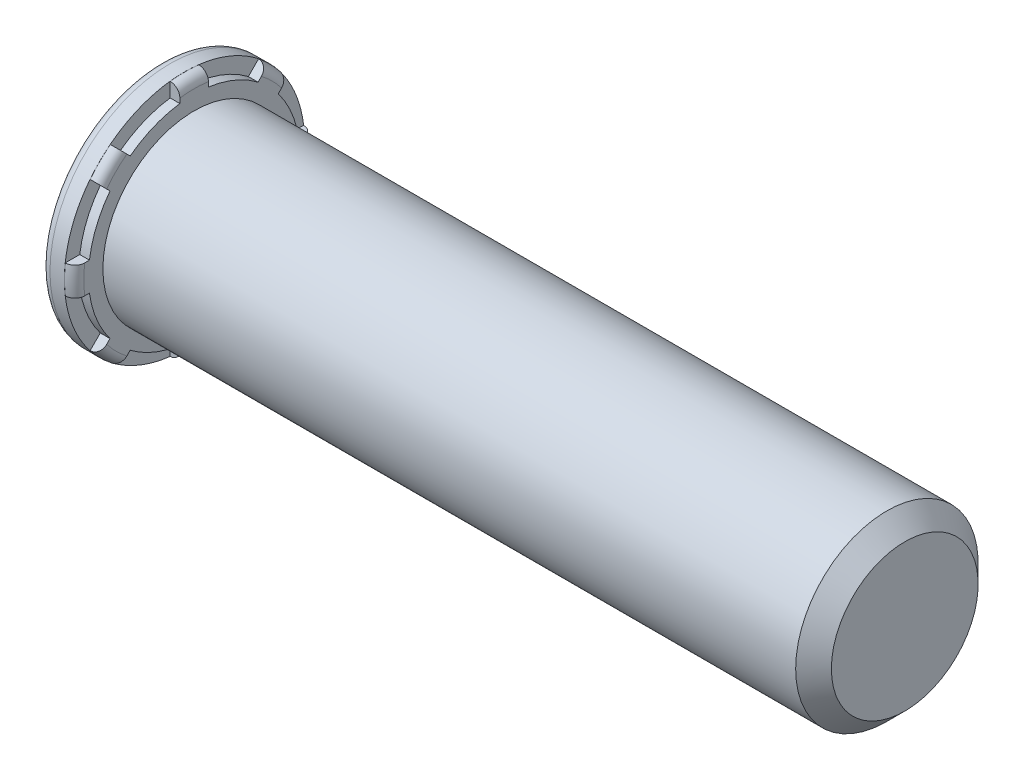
from build123d import *

# Parameters (mm, degrees)
RIBCUT_START     = -0.25654
RIBCUT_DEPTH     = 0.25654
RIBCUTSPAT_COUNT = 8
RIBCUTSPAT_ANGLE = 315


with BuildPart() as part:
    # BodySke → BaseBody (revolve)
    with BuildSketch(Plane.XY, mode=Mode.PRIVATE) as basebody_sk:
        with BuildLine():
            Line((-0.635, 2.921), (-0.635, 0))
            Line((-0.635, 0), (19.05, 0))
            Line((19.05, 0), (19.05, 1.94056))
            Line((19.05, 1.94056), (18.57756, 2.413))
            Line((18.57756, 2.413), (0.25654, 2.413))
            Line((0.25654, 2.413), (0.25654, 2.91846))
            ThreePointArc((0.25654, 2.91846), (0.182145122, 3.098065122), (0.00254, 3.17246))
            Line((0.00254, 3.17246), (0, 3.17246))
            Line((0, 3.17246), (0, 3.175))
            Line((0, 3.175), (-0.381, 3.175))
            ThreePointArc((-0.381, 3.175), (-0.560605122, 3.100605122), (-0.635, 2.921))
        make_face()
    revolve(basebody_sk.sketch.rotate(Axis((0, 0, 0), (1, 0, 0)), 90), axis=Axis((0, 0, 0), (1, 0, 0)))

    # RibCutSke → RibCut (cut)
    with BuildSketch(Plane(origin=(0.25654, 1.794401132, -0.090952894), x_dir=(0, 0, -1), z_dir=(1, 0, 0)).offset(RIBCUT_START)):
        with BuildLine():
            Line((0.28652347, 0.973982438), (0.28652347, 1.35807989))
            ThreePointArc((0.28652347, 1.35807989), (1.124067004, 1.138916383), (1.871271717, 0.701655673))
            Line((1.871271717, 0.701655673), (1.599673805, 0.43005776))
            ThreePointArc((1.599673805, 0.43005776), (0.978264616, 0.786918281), (0.28652347, 0.973982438))
        make_face()
    ribcut = extrude(amount=RIBCUT_DEPTH, mode=Mode.SUBTRACT)

    # RibCutsPat: RibCut ×8 about axis
    ribcutspat_axis = Axis((0, 0, 0), (1, 0, 0))
    for i in range(1, RIBCUTSPAT_COUNT):
        add(ribcut.rotate(ribcutspat_axis, i * RIBCUTSPAT_ANGLE / (RIBCUTSPAT_COUNT - 1)), mode=Mode.SUBTRACT)


solid = part.part
